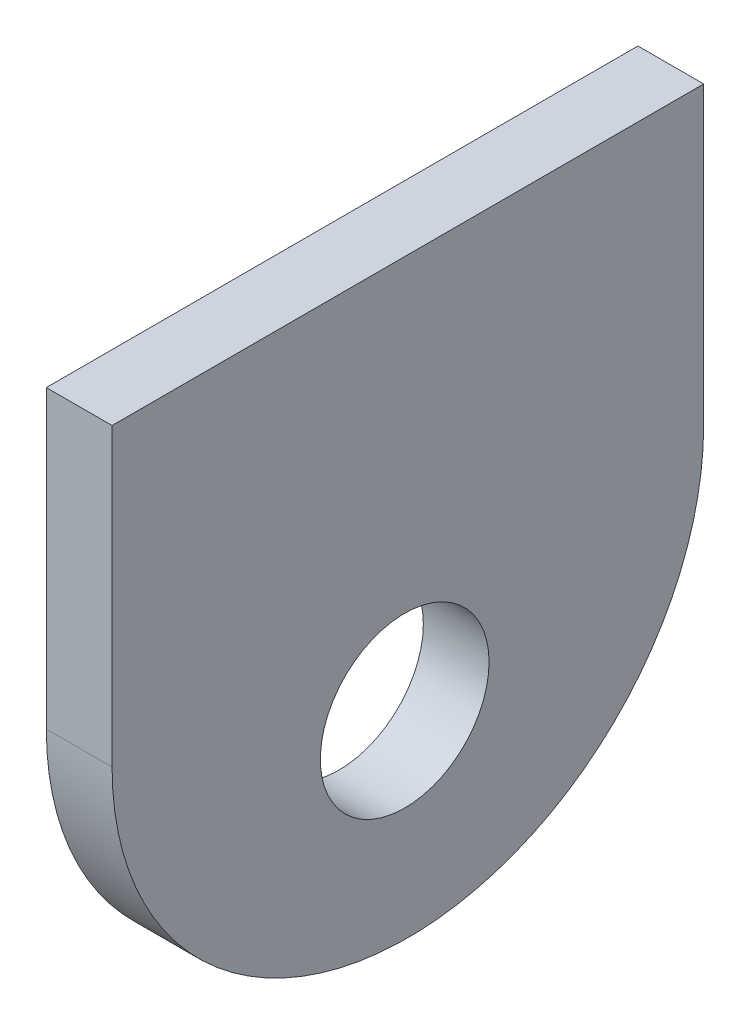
ISO-10303-21;
HEADER;
FILE_DESCRIPTION(('STEP AP214'),'2;1');
FILE_NAME('part.step','',(''),(''),'','','');
FILE_SCHEMA(('AUTOMOTIVE_DESIGN { 1 0 10303 214 1 1 1 1 }'));
ENDSEC;
DATA;
#1=APPLICATION_CONTEXT('core data for automotive mechanical design processes');
#2=APPLICATION_PROTOCOL_DEFINITION('international standard','automotive_design',2000,#1);
#3=PRODUCT_CONTEXT('',#1,'mechanical');
#4=PRODUCT('Part','Part','',(#3));
#5=PRODUCT_RELATED_PRODUCT_CATEGORY('part','',(#4));
#6=PRODUCT_DEFINITION_FORMATION('','',#4);
#7=PRODUCT_DEFINITION_CONTEXT('part definition',#1,'design');
#8=PRODUCT_DEFINITION('design','',#6,#7);
#9=PRODUCT_DEFINITION_SHAPE('','',#8);
#10=(LENGTH_UNIT() NAMED_UNIT(*) SI_UNIT(.MILLI.,.METRE.));
#11=(NAMED_UNIT(*) PLANE_ANGLE_UNIT() SI_UNIT($,.RADIAN.));
#12=(NAMED_UNIT(*) SI_UNIT($,.STERADIAN.) SOLID_ANGLE_UNIT());
#13=UNCERTAINTY_MEASURE_WITH_UNIT(LENGTH_MEASURE(1.E-05),#10,'distance_accuracy_value','');
#14=(GEOMETRIC_REPRESENTATION_CONTEXT(3) GLOBAL_UNCERTAINTY_ASSIGNED_CONTEXT((#13)) GLOBAL_UNIT_ASSIGNED_CONTEXT((#10,
#11,#12)) REPRESENTATION_CONTEXT('',''));
#15=CARTESIAN_POINT('',(0.,0.,0.));
#16=DIRECTION('',(0.,0.,1.));
#17=DIRECTION('',(1.,0.,0.));
#18=AXIS2_PLACEMENT_3D('',#15,#16,#17);
#19=CARTESIAN_POINT('',(3.,0.,0.));
#20=DIRECTION('',(1.,0.,0.));
#21=DIRECTION('',(0.,0.,-1.));
#22=AXIS2_PLACEMENT_3D('',#19,#20,#21);
#23=PLANE('',#22);
#24=CARTESIAN_POINT('',(3.,0.,0.));
#25=DIRECTION('',(1.,0.,0.));
#26=DIRECTION('',(0.,0.,-1.));
#27=AXIS2_PLACEMENT_3D('',#24,#25,#26);
#28=CIRCLE('',#27,13.5);
#29=CARTESIAN_POINT('',(3.,0.,13.5));
#30=VERTEX_POINT('',#29);
#31=CARTESIAN_POINT('',(3.,0.,-13.5));
#32=VERTEX_POINT('',#31);
#33=EDGE_CURVE('E85',#30,#32,#28,.T.);
#34=ORIENTED_EDGE('',*,*,#33,.T.);
#35=DIRECTION('',(0.,1.,0.));
#36=VECTOR('',#35,1.);
#37=CARTESIAN_POINT('',(3.,13.5,-13.5));
#38=LINE('',#37,#36);
#39=CARTESIAN_POINT('',(3.,13.5,-13.5));
#40=VERTEX_POINT('',#39);
#41=EDGE_CURVE('E80',#32,#40,#38,.T.);
#42=ORIENTED_EDGE('',*,*,#41,.T.);
#43=DIRECTION('',(0.,0.,1.));
#44=VECTOR('',#43,1.);
#45=CARTESIAN_POINT('',(3.,13.5,13.5));
#46=LINE('',#45,#44);
#47=CARTESIAN_POINT('',(3.,13.5,13.5));
#48=VERTEX_POINT('',#47);
#49=EDGE_CURVE('E83',#40,#48,#46,.T.);
#50=ORIENTED_EDGE('',*,*,#49,.T.);
#51=DIRECTION('',(0.,-1.,0.));
#52=VECTOR('',#51,1.);
#53=CARTESIAN_POINT('',(3.,0.,13.5));
#54=LINE('',#53,#52);
#55=EDGE_CURVE('E50',#48,#30,#54,.T.);
#56=ORIENTED_EDGE('',*,*,#55,.T.);
#57=EDGE_LOOP('',(#34,#42,#50,#56));
#58=FACE_BOUND('',#57,.T.);
#59=CARTESIAN_POINT('',(3.,-4.44896935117,0.143951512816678));
#60=DIRECTION('',(1.,0.,0.));
#61=DIRECTION('',(0.,0.,-1.));
#62=AXIS2_PLACEMENT_3D('',#59,#60,#61);
#63=CIRCLE('',#62,3.85);
#64=CARTESIAN_POINT('',(3.,-4.44896935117,-3.70604848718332));
#65=VERTEX_POINT('',#64);
#66=EDGE_CURVE('E100',#65,#65,#63,.T.);
#67=ORIENTED_EDGE('',*,*,#66,.F.);
#68=EDGE_LOOP('',(#67));
#69=FACE_BOUND('',#68,.T.);
#70=ADVANCED_FACE('F33',(#58,#69),#23,.T.);
#71=CARTESIAN_POINT('',(0.,0.,0.));
#72=DIRECTION('',(1.,0.,0.));
#73=DIRECTION('',(0.,0.,-1.));
#74=AXIS2_PLACEMENT_3D('',#71,#72,#73);
#75=PLANE('',#74);
#76=CARTESIAN_POINT('',(0.,0.,0.));
#77=DIRECTION('',(1.,0.,0.));
#78=DIRECTION('',(0.,0.,-1.));
#79=AXIS2_PLACEMENT_3D('',#76,#77,#78);
#80=CIRCLE('',#79,13.5);
#81=CARTESIAN_POINT('',(0.,0.,13.5));
#82=VERTEX_POINT('',#81);
#83=CARTESIAN_POINT('',(0.,0.,-13.5));
#84=VERTEX_POINT('',#83);
#85=EDGE_CURVE('E97',#82,#84,#80,.T.);
#86=ORIENTED_EDGE('',*,*,#85,.F.);
#87=DIRECTION('',(0.,-1.,0.));
#88=VECTOR('',#87,1.);
#89=CARTESIAN_POINT('',(0.,0.,13.5));
#90=LINE('',#89,#88);
#91=CARTESIAN_POINT('',(0.,13.5,13.5));
#92=VERTEX_POINT('',#91);
#93=EDGE_CURVE('E73',#92,#82,#90,.T.);
#94=ORIENTED_EDGE('',*,*,#93,.F.);
#95=DIRECTION('',(0.,0.,1.));
#96=VECTOR('',#95,1.);
#97=CARTESIAN_POINT('',(0.,13.5,13.5));
#98=LINE('',#97,#96);
#99=CARTESIAN_POINT('',(0.,13.5,-13.5));
#100=VERTEX_POINT('',#99);
#101=EDGE_CURVE('E67',#100,#92,#98,.T.);
#102=ORIENTED_EDGE('',*,*,#101,.F.);
#103=DIRECTION('',(0.,1.,0.));
#104=VECTOR('',#103,1.);
#105=CARTESIAN_POINT('',(0.,13.5,-13.5));
#106=LINE('',#105,#104);
#107=EDGE_CURVE('E89',#84,#100,#106,.T.);
#108=ORIENTED_EDGE('',*,*,#107,.F.);
#109=EDGE_LOOP('',(#86,#94,#102,#108));
#110=FACE_BOUND('',#109,.T.);
#111=CARTESIAN_POINT('',(0.,-4.44896935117,0.143951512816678));
#112=DIRECTION('',(1.,0.,0.));
#113=DIRECTION('',(0.,0.,-1.));
#114=AXIS2_PLACEMENT_3D('',#111,#112,#113);
#115=CIRCLE('',#114,3.85);
#116=CARTESIAN_POINT('',(0.,-4.44896935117,-3.70604848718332));
#117=VERTEX_POINT('',#116);
#118=EDGE_CURVE('E112',#117,#117,#115,.T.);
#119=ORIENTED_EDGE('',*,*,#118,.T.);
#120=EDGE_LOOP('',(#119));
#121=FACE_BOUND('',#120,.T.);
#122=ADVANCED_FACE('F108',(#110,#121),#75,.F.);
#123=CARTESIAN_POINT('',(3.,0.,0.));
#124=DIRECTION('',(-1.,0.,0.));
#125=DIRECTION('',(0.,0.,1.));
#126=AXIS2_PLACEMENT_3D('',#123,#124,#125);
#127=CYLINDRICAL_SURFACE('',#126,13.5);
#128=ORIENTED_EDGE('',*,*,#85,.T.);
#129=DIRECTION('',(-1.,0.,0.));
#130=VECTOR('',#129,1.);
#131=CARTESIAN_POINT('',(3.,0.,-13.5));
#132=LINE('',#131,#130);
#133=EDGE_CURVE('E11',#32,#84,#132,.T.);
#134=ORIENTED_EDGE('',*,*,#133,.F.);
#135=ORIENTED_EDGE('',*,*,#33,.F.);
#136=DIRECTION('',(-1.,0.,0.));
#137=VECTOR('',#136,1.);
#138=CARTESIAN_POINT('',(3.,0.,13.5));
#139=LINE('',#138,#137);
#140=EDGE_CURVE('E93',#30,#82,#139,.T.);
#141=ORIENTED_EDGE('',*,*,#140,.T.);
#142=EDGE_LOOP('',(#128,#134,#135,#141));
#143=FACE_BOUND('',#142,.T.);
#144=ADVANCED_FACE('F35',(#143),#127,.T.);
#145=CARTESIAN_POINT('',(3.,13.5,-13.5));
#146=DIRECTION('',(0.,0.,1.));
#147=DIRECTION('',(1.,0.,0.));
#148=AXIS2_PLACEMENT_3D('',#145,#146,#147);
#149=PLANE('',#148);
#150=ORIENTED_EDGE('',*,*,#107,.T.);
#151=DIRECTION('',(-1.,0.,0.));
#152=VECTOR('',#151,1.);
#153=CARTESIAN_POINT('',(3.,13.5,-13.5));
#154=LINE('',#153,#152);
#155=EDGE_CURVE('E42',#40,#100,#154,.T.);
#156=ORIENTED_EDGE('',*,*,#155,.F.);
#157=ORIENTED_EDGE('',*,*,#41,.F.);
#158=ORIENTED_EDGE('',*,*,#133,.T.);
#159=EDGE_LOOP('',(#150,#156,#157,#158));
#160=FACE_BOUND('',#159,.T.);
#161=ADVANCED_FACE('F88',(#160),#149,.F.);
#162=CARTESIAN_POINT('',(3.,13.5,13.5));
#163=DIRECTION('',(0.,-1.,0.));
#164=DIRECTION('',(0.,0.,-1.));
#165=AXIS2_PLACEMENT_3D('',#162,#163,#164);
#166=PLANE('',#165);
#167=ORIENTED_EDGE('',*,*,#101,.T.);
#168=DIRECTION('',(-1.,0.,0.));
#169=VECTOR('',#168,1.);
#170=CARTESIAN_POINT('',(3.,13.5,13.5));
#171=LINE('',#170,#169);
#172=EDGE_CURVE('E90',#48,#92,#171,.T.);
#173=ORIENTED_EDGE('',*,*,#172,.F.);
#174=ORIENTED_EDGE('',*,*,#49,.F.);
#175=ORIENTED_EDGE('',*,*,#155,.T.);
#176=EDGE_LOOP('',(#167,#173,#174,#175));
#177=FACE_BOUND('',#176,.T.);
#178=ADVANCED_FACE('F91',(#177),#166,.F.);
#179=CARTESIAN_POINT('',(3.,0.,13.5));
#180=DIRECTION('',(0.,0.,-1.));
#181=DIRECTION('',(-1.,0.,0.));
#182=AXIS2_PLACEMENT_3D('',#179,#180,#181);
#183=PLANE('',#182);
#184=ORIENTED_EDGE('',*,*,#93,.T.);
#185=ORIENTED_EDGE('',*,*,#140,.F.);
#186=ORIENTED_EDGE('',*,*,#55,.F.);
#187=ORIENTED_EDGE('',*,*,#172,.T.);
#188=EDGE_LOOP('',(#184,#185,#186,#187));
#189=FACE_BOUND('',#188,.T.);
#190=ADVANCED_FACE('F105',(#189),#183,.F.);
#191=CARTESIAN_POINT('',(3.,-4.44896935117,0.143951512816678));
#192=DIRECTION('',(-1.,0.,0.));
#193=DIRECTION('',(0.,0.,1.));
#194=AXIS2_PLACEMENT_3D('',#191,#192,#193);
#195=CYLINDRICAL_SURFACE('',#194,3.85);
#196=ORIENTED_EDGE('',*,*,#66,.T.);
#197=EDGE_LOOP('',(#196));
#198=FACE_BOUND('',#197,.T.);
#199=ORIENTED_EDGE('',*,*,#118,.F.);
#200=EDGE_LOOP('',(#199));
#201=FACE_BOUND('',#200,.T.);
#202=ADVANCED_FACE('F118',(#198,#201),#195,.F.);
#203=CLOSED_SHELL('',(#70,#122,#144,#161,#178,#190,#202));
#204=MANIFOLD_SOLID_BREP('B2',#203);
#205=ADVANCED_BREP_SHAPE_REPRESENTATION('',(#18,#204),#14);
#206=SHAPE_DEFINITION_REPRESENTATION(#9,#205);
ENDSEC;
END-ISO-10303-21;
